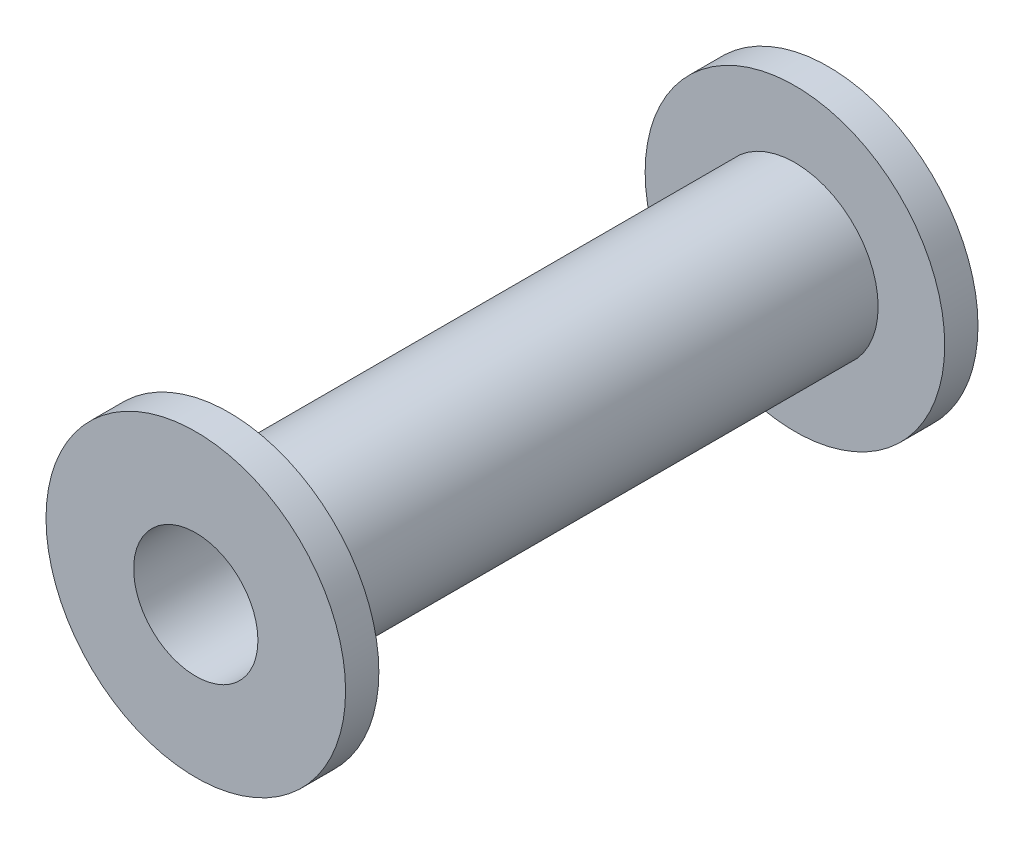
ISO-10303-21;
HEADER;
FILE_DESCRIPTION(('STEP AP214'),'2;1');
FILE_NAME('part.step','',(''),(''),'','','');
FILE_SCHEMA(('AUTOMOTIVE_DESIGN { 1 0 10303 214 1 1 1 1 }'));
ENDSEC;
DATA;
#1=APPLICATION_CONTEXT('core data for automotive mechanical design processes');
#2=APPLICATION_PROTOCOL_DEFINITION('international standard','automotive_design',2000,#1);
#3=PRODUCT_CONTEXT('',#1,'mechanical');
#4=PRODUCT('Part','Part','',(#3));
#5=PRODUCT_RELATED_PRODUCT_CATEGORY('part','',(#4));
#6=PRODUCT_DEFINITION_FORMATION('','',#4);
#7=PRODUCT_DEFINITION_CONTEXT('part definition',#1,'design');
#8=PRODUCT_DEFINITION('design','',#6,#7);
#9=PRODUCT_DEFINITION_SHAPE('','',#8);
#10=(LENGTH_UNIT() NAMED_UNIT(*) SI_UNIT(.MILLI.,.METRE.));
#11=(NAMED_UNIT(*) PLANE_ANGLE_UNIT() SI_UNIT($,.RADIAN.));
#12=(NAMED_UNIT(*) SI_UNIT($,.STERADIAN.) SOLID_ANGLE_UNIT());
#13=UNCERTAINTY_MEASURE_WITH_UNIT(LENGTH_MEASURE(1.E-05),#10,'distance_accuracy_value','');
#14=(GEOMETRIC_REPRESENTATION_CONTEXT(3) GLOBAL_UNCERTAINTY_ASSIGNED_CONTEXT((#13)) GLOBAL_UNIT_ASSIGNED_CONTEXT((#10,
#11,#12)) REPRESENTATION_CONTEXT('',''));
#15=CARTESIAN_POINT('',(0.,0.,0.));
#16=DIRECTION('',(0.,0.,1.));
#17=DIRECTION('',(1.,0.,0.));
#18=AXIS2_PLACEMENT_3D('',#15,#16,#17);
#19=CARTESIAN_POINT('',(0.,0.,3.));
#20=DIRECTION('',(0.,0.,1.));
#21=DIRECTION('',(1.,0.,0.));
#22=AXIS2_PLACEMENT_3D('',#19,#20,#21);
#23=PLANE('',#22);
#24=CARTESIAN_POINT('',(0.,0.,3.));
#25=DIRECTION('',(0.,0.,1.));
#26=DIRECTION('',(1.,0.,0.));
#27=AXIS2_PLACEMENT_3D('',#24,#25,#26);
#28=CIRCLE('',#27,13.5);
#29=CARTESIAN_POINT('',(13.5,0.,3.));
#30=VERTEX_POINT('',#29);
#31=EDGE_CURVE('E10',#30,#30,#28,.T.);
#32=ORIENTED_EDGE('',*,*,#31,.T.);
#33=EDGE_LOOP('',(#32));
#34=FACE_BOUND('',#33,.T.);
#35=CARTESIAN_POINT('',(0.,0.,3.));
#36=DIRECTION('',(0.,0.,1.));
#37=DIRECTION('',(1.,0.,0.));
#38=AXIS2_PLACEMENT_3D('',#35,#36,#37);
#39=CIRCLE('',#38,7.5);
#40=CARTESIAN_POINT('',(7.5,0.,3.));
#41=VERTEX_POINT('',#40);
#42=EDGE_CURVE('E56',#41,#41,#39,.T.);
#43=ORIENTED_EDGE('',*,*,#42,.F.);
#44=EDGE_LOOP('',(#43));
#45=FACE_BOUND('',#44,.T.);
#46=ADVANCED_FACE('F37',(#34,#45),#23,.T.);
#47=CARTESIAN_POINT('',(0.,0.,0.));
#48=DIRECTION('',(0.,0.,1.));
#49=DIRECTION('',(1.,0.,0.));
#50=AXIS2_PLACEMENT_3D('',#47,#48,#49);
#51=PLANE('',#50);
#52=CARTESIAN_POINT('',(0.,0.,0.));
#53=DIRECTION('',(0.,0.,1.));
#54=DIRECTION('',(1.,0.,0.));
#55=AXIS2_PLACEMENT_3D('',#52,#53,#54);
#56=CIRCLE('',#55,13.5);
#57=CARTESIAN_POINT('',(13.5,0.,0.));
#58=VERTEX_POINT('',#57);
#59=EDGE_CURVE('E41',#58,#58,#56,.T.);
#60=ORIENTED_EDGE('',*,*,#59,.F.);
#61=EDGE_LOOP('',(#60));
#62=FACE_BOUND('',#61,.T.);
#63=CARTESIAN_POINT('',(0.,0.,0.));
#64=DIRECTION('',(0.,0.,1.));
#65=DIRECTION('',(1.,0.,0.));
#66=AXIS2_PLACEMENT_3D('',#63,#64,#65);
#67=CIRCLE('',#66,5.6);
#68=CARTESIAN_POINT('',(5.6,0.,0.));
#69=VERTEX_POINT('',#68);
#70=EDGE_CURVE('E50',#69,#69,#67,.T.);
#71=ORIENTED_EDGE('',*,*,#70,.T.);
#72=EDGE_LOOP('',(#71));
#73=FACE_BOUND('',#72,.T.);
#74=ADVANCED_FACE('F94',(#62,#73),#51,.F.);
#75=CARTESIAN_POINT('',(0.,0.,3.));
#76=DIRECTION('',(0.,0.,-1.));
#77=DIRECTION('',(-1.,0.,0.));
#78=AXIS2_PLACEMENT_3D('',#75,#76,#77);
#79=CYLINDRICAL_SURFACE('',#78,13.5);
#80=ORIENTED_EDGE('',*,*,#31,.F.);
#81=EDGE_LOOP('',(#80));
#82=FACE_BOUND('',#81,.T.);
#83=ORIENTED_EDGE('',*,*,#59,.T.);
#84=EDGE_LOOP('',(#83));
#85=FACE_BOUND('',#84,.T.);
#86=ADVANCED_FACE('F39',(#82,#85),#79,.T.);
#87=CARTESIAN_POINT('',(0.,0.,3.));
#88=DIRECTION('',(0.,0.,-1.));
#89=DIRECTION('',(-1.,0.,0.));
#90=AXIS2_PLACEMENT_3D('',#87,#88,#89);
#91=CYLINDRICAL_SURFACE('',#90,5.6);
#92=ORIENTED_EDGE('',*,*,#70,.F.);
#93=EDGE_LOOP('',(#92));
#94=FACE_BOUND('',#93,.T.);
#95=CARTESIAN_POINT('',(0.,0.,57.));
#96=DIRECTION('',(0.,0.,1.));
#97=DIRECTION('',(1.,0.,0.));
#98=AXIS2_PLACEMENT_3D('',#95,#96,#97);
#99=CIRCLE('',#98,5.6);
#100=CARTESIAN_POINT('',(5.6,0.,57.));
#101=VERTEX_POINT('',#100);
#102=EDGE_CURVE('E68',#101,#101,#99,.T.);
#103=ORIENTED_EDGE('',*,*,#102,.T.);
#104=EDGE_LOOP('',(#103));
#105=FACE_BOUND('',#104,.T.);
#106=ADVANCED_FACE('F76',(#94,#105),#91,.F.);
#107=CARTESIAN_POINT('',(0.,0.,54.));
#108=DIRECTION('',(0.,0.,-1.));
#109=DIRECTION('',(-1.,0.,0.));
#110=AXIS2_PLACEMENT_3D('',#107,#108,#109);
#111=CYLINDRICAL_SURFACE('',#110,7.5);
#112=CARTESIAN_POINT('',(0.,0.,54.));
#113=DIRECTION('',(0.,0.,1.));
#114=DIRECTION('',(1.,0.,0.));
#115=AXIS2_PLACEMENT_3D('',#112,#113,#114);
#116=CIRCLE('',#115,7.5);
#117=CARTESIAN_POINT('',(7.5,0.,54.));
#118=VERTEX_POINT('',#117);
#119=EDGE_CURVE('E55',#118,#118,#116,.T.);
#120=ORIENTED_EDGE('',*,*,#119,.F.);
#121=EDGE_LOOP('',(#120));
#122=FACE_BOUND('',#121,.T.);
#123=ORIENTED_EDGE('',*,*,#42,.T.);
#124=EDGE_LOOP('',(#123));
#125=FACE_BOUND('',#124,.T.);
#126=ADVANCED_FACE('F81',(#122,#125),#111,.T.);
#127=CARTESIAN_POINT('',(0.,0.,57.));
#128=DIRECTION('',(0.,0.,1.));
#129=DIRECTION('',(1.,0.,0.));
#130=AXIS2_PLACEMENT_3D('',#127,#128,#129);
#131=PLANE('',#130);
#132=CARTESIAN_POINT('',(0.,0.,57.));
#133=DIRECTION('',(0.,0.,1.));
#134=DIRECTION('',(1.,0.,0.));
#135=AXIS2_PLACEMENT_3D('',#132,#133,#134);
#136=CIRCLE('',#135,13.5);
#137=CARTESIAN_POINT('',(13.5,0.,57.));
#138=VERTEX_POINT('',#137);
#139=EDGE_CURVE('E60',#138,#138,#136,.T.);
#140=ORIENTED_EDGE('',*,*,#139,.T.);
#141=EDGE_LOOP('',(#140));
#142=FACE_BOUND('',#141,.T.);
#143=ORIENTED_EDGE('',*,*,#102,.F.);
#144=EDGE_LOOP('',(#143));
#145=FACE_BOUND('',#144,.T.);
#146=ADVANCED_FACE('F78',(#142,#145),#131,.T.);
#147=CARTESIAN_POINT('',(0.,0.,54.));
#148=DIRECTION('',(0.,0.,1.));
#149=DIRECTION('',(1.,0.,0.));
#150=AXIS2_PLACEMENT_3D('',#147,#148,#149);
#151=PLANE('',#150);
#152=ORIENTED_EDGE('',*,*,#119,.T.);
#153=EDGE_LOOP('',(#152));
#154=FACE_BOUND('',#153,.T.);
#155=CARTESIAN_POINT('',(0.,0.,54.));
#156=DIRECTION('',(0.,0.,1.));
#157=DIRECTION('',(1.,0.,0.));
#158=AXIS2_PLACEMENT_3D('',#155,#156,#157);
#159=CIRCLE('',#158,13.5);
#160=CARTESIAN_POINT('',(13.5,0.,54.));
#161=VERTEX_POINT('',#160);
#162=EDGE_CURVE('E64',#161,#161,#159,.T.);
#163=ORIENTED_EDGE('',*,*,#162,.F.);
#164=EDGE_LOOP('',(#163));
#165=FACE_BOUND('',#164,.T.);
#166=ADVANCED_FACE('F80',(#154,#165),#151,.F.);
#167=CARTESIAN_POINT('',(0.,0.,57.));
#168=DIRECTION('',(0.,0.,-1.));
#169=DIRECTION('',(-1.,0.,0.));
#170=AXIS2_PLACEMENT_3D('',#167,#168,#169);
#171=CYLINDRICAL_SURFACE('',#170,13.5);
#172=ORIENTED_EDGE('',*,*,#139,.F.);
#173=EDGE_LOOP('',(#172));
#174=FACE_BOUND('',#173,.T.);
#175=ORIENTED_EDGE('',*,*,#162,.T.);
#176=EDGE_LOOP('',(#175));
#177=FACE_BOUND('',#176,.T.);
#178=ADVANCED_FACE('F88',(#174,#177),#171,.T.);
#179=CLOSED_SHELL('',(#46,#74,#86,#106,#126,#146,#166,#178));
#180=MANIFOLD_SOLID_BREP('B2',#179);
#181=ADVANCED_BREP_SHAPE_REPRESENTATION('',(#18,#180),#14);
#182=SHAPE_DEFINITION_REPRESENTATION(#9,#181);
ENDSEC;
END-ISO-10303-21;
